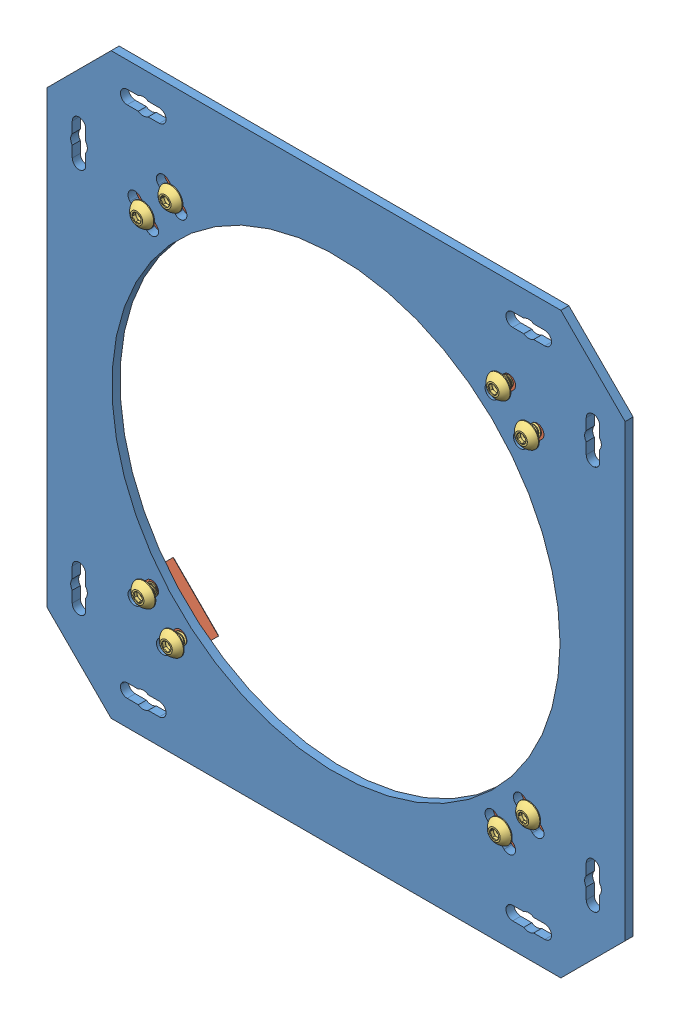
SolidWorks assembly ws_bearing_plate_asm_revc_2.sldasm, configuration Default (file format 6000). Lengths in mm.
Overall size (228.6 228.6 12.7).
13 component instances, 3 part files, 0 mates.
Components (placement in the parent):
- ws_bearing_plate_revc_2-1: ws_bearing_plate_revc_2.sldprt [Default] at origin size (228.6 228.6 3.17)
- ws_bushing_pad_revb_2-1: ws_bushing_pad_revb_2.sldprt [Default] at (-86.0501 -68.6105 0) x (0.707107 -0.707107 0) z (0 0 -1) size (25.4 15.88 6.35)
- ws_bushing_pad_revb_2-2: ws_bushing_pad_revb_2.sldprt [Default] at (68.6105 -86.0501 0) x (0.707107 0.707107 0) z (0 0 -1) size (25.4 15.88 6.35)
- ws_bushing_pad_revb_2-3: ws_bushing_pad_revb_2.sldprt [Default] at (86.0501 68.6105 0) x (-0.707107 0.707107 0) z (0 0 -1) size (25.4 15.88 6.35)
- ws_bushing_pad_revb_2-4: ws_bushing_pad_revb_2.sldprt [Default] at (-68.6105 86.0501 0) x (-0.707107 -0.707107 0) z (0 0 -1) size (25.4 15.88 6.35)
- bhcs_91255A240_2-1: bhcs_91255A240_2.sldprt [Default] at (-75.7941 -65.0896 3.175) size (9.26 9.24 12.7)
- bhcs_91255A240_2-2: bhcs_91255A240_2.sldprt [Default] at (-64.5687 -76.3149 3.175) x (-0.666125 0.74584 0) z (0 0 1) size (9.26 9.24 12.7)
- bhcs_91255A240_2-3: bhcs_91255A240_2.sldprt [Default] at (65.0896 -75.7941 3.175) x (0 1 0) z (0 0 1) size (9.26 9.24 12.7)
- bhcs_91255A240_2-4: bhcs_91255A240_2.sldprt [Default] at (76.3149 -64.5687 3.175) x (-0.74584 -0.666125 0) z (0 0 1) size (9.26 9.24 12.7)
- bhcs_91255A240_2-5: bhcs_91255A240_2.sldprt [Default] at (75.7941 65.0896 3.175) x (-1 0 0) z (0 0 1) size (9.26 9.24 12.7)
- bhcs_91255A240_2-6: bhcs_91255A240_2.sldprt [Default] at (64.5687 76.3149 3.175) x (0.666125 -0.74584 0) z (0 0 1) size (9.26 9.24 12.7)
- bhcs_91255A240_2-7: bhcs_91255A240_2.sldprt [Default] at (-65.0896 75.7941 3.175) x (0 -1 0) z (0 0 1) size (9.26 9.24 12.7)
- bhcs_91255A240_2-8: bhcs_91255A240_2.sldprt [Default] at (-76.3149 64.5687 3.175) x (0.74584 0.666125 0) z (0 0 1) size (9.26 9.24 12.7)
